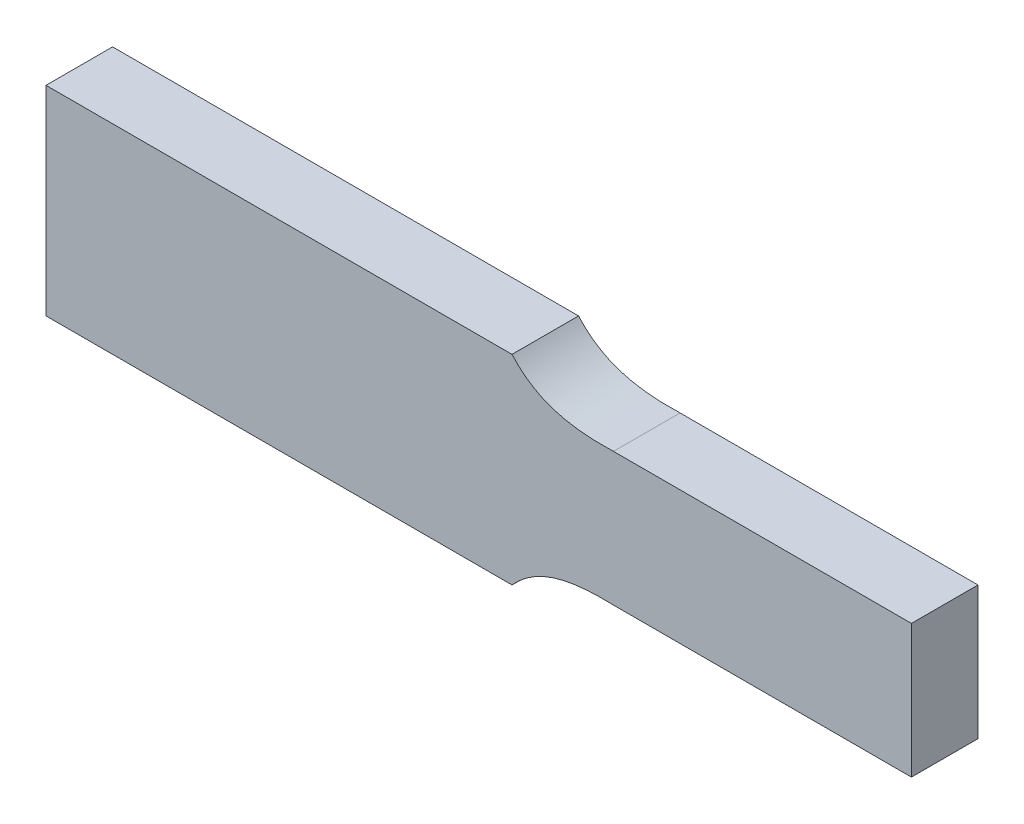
ISO-10303-21;
HEADER;
FILE_DESCRIPTION(('STEP AP214'),'2;1');
FILE_NAME('part.step','',(''),(''),'','','');
FILE_SCHEMA(('AUTOMOTIVE_DESIGN { 1 0 10303 214 1 1 1 1 }'));
ENDSEC;
DATA;
#1=APPLICATION_CONTEXT('core data for automotive mechanical design processes');
#2=APPLICATION_PROTOCOL_DEFINITION('international standard','automotive_design',2000,#1);
#3=PRODUCT_CONTEXT('',#1,'mechanical');
#4=PRODUCT('Part','Part','',(#3));
#5=PRODUCT_RELATED_PRODUCT_CATEGORY('part','',(#4));
#6=PRODUCT_DEFINITION_FORMATION('','',#4);
#7=PRODUCT_DEFINITION_CONTEXT('part definition',#1,'design');
#8=PRODUCT_DEFINITION('design','',#6,#7);
#9=PRODUCT_DEFINITION_SHAPE('','',#8);
#10=(LENGTH_UNIT() NAMED_UNIT(*) SI_UNIT(.MILLI.,.METRE.));
#11=(NAMED_UNIT(*) PLANE_ANGLE_UNIT() SI_UNIT($,.RADIAN.));
#12=(NAMED_UNIT(*) SI_UNIT($,.STERADIAN.) SOLID_ANGLE_UNIT());
#13=UNCERTAINTY_MEASURE_WITH_UNIT(LENGTH_MEASURE(1.E-05),#10,'distance_accuracy_value','');
#14=(GEOMETRIC_REPRESENTATION_CONTEXT(3) GLOBAL_UNCERTAINTY_ASSIGNED_CONTEXT((#13)) GLOBAL_UNIT_ASSIGNED_CONTEXT((#10,
#11,#12)) REPRESENTATION_CONTEXT('',''));
#15=CARTESIAN_POINT('',(0.,0.,0.));
#16=DIRECTION('',(0.,0.,1.));
#17=DIRECTION('',(1.,0.,0.));
#18=AXIS2_PLACEMENT_3D('',#15,#16,#17);
#19=CARTESIAN_POINT('',(0.,41.1830275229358,20.));
#20=DIRECTION('',(0.,-1.,0.));
#21=DIRECTION('',(1.,0.,0.));
#22=AXIS2_PLACEMENT_3D('',#19,#20,#21);
#23=PLANE('',#22);
#24=DIRECTION('',(-1.,0.,0.));
#25=VECTOR('',#24,1.);
#26=CARTESIAN_POINT('',(0.,41.1830275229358,0.));
#27=LINE('',#26,#25);
#28=CARTESIAN_POINT('',(140.,41.1830275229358,0.));
#29=VERTEX_POINT('',#28);
#30=CARTESIAN_POINT('',(0.,41.1830275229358,0.));
#31=VERTEX_POINT('',#30);
#32=EDGE_CURVE('E137',#29,#31,#27,.T.);
#33=ORIENTED_EDGE('',*,*,#32,.T.);
#34=DIRECTION('',(0.,0.,-1.));
#35=VECTOR('',#34,1.);
#36=CARTESIAN_POINT('',(0.,41.1830275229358,20.));
#37=LINE('',#36,#35);
#38=CARTESIAN_POINT('',(0.,41.1830275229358,20.));
#39=VERTEX_POINT('',#38);
#40=EDGE_CURVE('E11',#39,#31,#37,.T.);
#41=ORIENTED_EDGE('',*,*,#40,.F.);
#42=DIRECTION('',(-1.,0.,0.));
#43=VECTOR('',#42,1.);
#44=CARTESIAN_POINT('',(0.,41.1830275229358,20.));
#45=LINE('',#44,#43);
#46=CARTESIAN_POINT('',(140.,41.1830275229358,20.));
#47=VERTEX_POINT('',#46);
#48=EDGE_CURVE('E174',#47,#39,#45,.T.);
#49=ORIENTED_EDGE('',*,*,#48,.F.);
#50=DIRECTION('',(0.,0.,-1.));
#51=VECTOR('',#50,1.);
#52=CARTESIAN_POINT('',(140.,41.1830275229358,20.));
#53=LINE('',#52,#51);
#54=EDGE_CURVE('E130',#47,#29,#53,.T.);
#55=ORIENTED_EDGE('',*,*,#54,.T.);
#56=EDGE_LOOP('',(#33,#41,#49,#55));
#57=FACE_BOUND('',#56,.T.);
#58=ADVANCED_FACE('F38',(#57),#23,.F.);
#59=CARTESIAN_POINT('',(0.,-18.8169724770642,20.));
#60=DIRECTION('',(1.,0.,0.));
#61=DIRECTION('',(0.,0.,-1.));
#62=AXIS2_PLACEMENT_3D('',#59,#60,#61);
#63=PLANE('',#62);
#64=DIRECTION('',(0.,-1.,0.));
#65=VECTOR('',#64,1.);
#66=CARTESIAN_POINT('',(0.,-18.8169724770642,0.));
#67=LINE('',#66,#65);
#68=CARTESIAN_POINT('',(0.,-18.8169724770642,0.));
#69=VERTEX_POINT('',#68);
#70=EDGE_CURVE('E203',#31,#69,#67,.T.);
#71=ORIENTED_EDGE('',*,*,#70,.T.);
#72=DIRECTION('',(0.,0.,-1.));
#73=VECTOR('',#72,1.);
#74=CARTESIAN_POINT('',(0.,-18.8169724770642,20.));
#75=LINE('',#74,#73);
#76=CARTESIAN_POINT('',(0.,-18.8169724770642,20.));
#77=VERTEX_POINT('',#76);
#78=EDGE_CURVE('E46',#77,#69,#75,.T.);
#79=ORIENTED_EDGE('',*,*,#78,.F.);
#80=DIRECTION('',(0.,-1.,0.));
#81=VECTOR('',#80,1.);
#82=CARTESIAN_POINT('',(0.,-18.8169724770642,20.));
#83=LINE('',#82,#81);
#84=EDGE_CURVE('E97',#39,#77,#83,.T.);
#85=ORIENTED_EDGE('',*,*,#84,.F.);
#86=ORIENTED_EDGE('',*,*,#40,.T.);
#87=EDGE_LOOP('',(#71,#79,#85,#86));
#88=FACE_BOUND('',#87,.T.);
#89=ADVANCED_FACE('F218',(#88),#63,.F.);
#90=CARTESIAN_POINT('',(140.,-18.8169724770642,20.));
#91=DIRECTION('',(0.,1.,0.));
#92=DIRECTION('',(-1.,0.,0.));
#93=AXIS2_PLACEMENT_3D('',#90,#91,#92);
#94=PLANE('',#93);
#95=DIRECTION('',(1.,0.,0.));
#96=VECTOR('',#95,1.);
#97=CARTESIAN_POINT('',(140.,-18.8169724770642,0.));
#98=LINE('',#97,#96);
#99=CARTESIAN_POINT('',(140.,-18.8169724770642,0.));
#100=VERTEX_POINT('',#99);
#101=EDGE_CURVE('E199',#69,#100,#98,.T.);
#102=ORIENTED_EDGE('',*,*,#101,.T.);
#103=DIRECTION('',(0.,0.,-1.));
#104=VECTOR('',#103,1.);
#105=CARTESIAN_POINT('',(140.,-18.8169724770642,20.));
#106=LINE('',#105,#104);
#107=CARTESIAN_POINT('',(140.,-18.8169724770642,20.));
#108=VERTEX_POINT('',#107);
#109=EDGE_CURVE('E192',#108,#100,#106,.T.);
#110=ORIENTED_EDGE('',*,*,#109,.F.);
#111=DIRECTION('',(1.,0.,0.));
#112=VECTOR('',#111,1.);
#113=CARTESIAN_POINT('',(140.,-18.8169724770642,20.));
#114=LINE('',#113,#112);
#115=EDGE_CURVE('E168',#77,#108,#114,.T.);
#116=ORIENTED_EDGE('',*,*,#115,.F.);
#117=ORIENTED_EDGE('',*,*,#78,.T.);
#118=EDGE_LOOP('',(#102,#110,#116,#117));
#119=FACE_BOUND('',#118,.T.);
#120=ADVANCED_FACE('F161',(#119),#94,.F.);
#121=CARTESIAN_POINT('',(140.,-18.8169724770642,20.));
#122=CARTESIAN_POINT('',(142.236718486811,-16.2606598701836,20.));
#123=CARTESIAN_POINT('',(151.161976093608,-9.31456617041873,20.));
#124=CARTESIAN_POINT('',(162.987656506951,-8.57923036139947,20.));
#125=CARTESIAN_POINT('',(170.489829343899,-8.81697247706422,20.));
#126=B_SPLINE_CURVE_WITH_KNOTS('',3,(#121,#122,#123,#124,#125),.UNSPECIFIED.,.F.,.F.,(4,1,4),
(0.,0.308404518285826,1.),.UNSPECIFIED.);
#127=DIRECTION('',(0.,0.,-1.));
#128=VECTOR('',#127,1.);
#129=SURFACE_OF_LINEAR_EXTRUSION('',#126,#128);
#130=CARTESIAN_POINT('',(140.,-18.8169724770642,0.));
#131=CARTESIAN_POINT('',(142.236718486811,-16.2606598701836,0.));
#132=CARTESIAN_POINT('',(151.161976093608,-9.31456617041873,0.));
#133=CARTESIAN_POINT('',(162.987656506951,-8.57923036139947,0.));
#134=CARTESIAN_POINT('',(170.489829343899,-8.81697247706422,0.));
#135=B_SPLINE_CURVE_WITH_KNOTS('',3,(#130,#131,#132,#133,#134),.UNSPECIFIED.,.F.,.F.,(4,1,4),
(0.,0.308404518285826,1.),.UNSPECIFIED.);
#136=CARTESIAN_POINT('',(170.489829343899,-8.81697247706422,0.));
#137=VERTEX_POINT('',#136);
#138=EDGE_CURVE('E205',#100,#137,#135,.T.);
#139=ORIENTED_EDGE('',*,*,#138,.T.);
#140=DIRECTION('',(0.,0.,-1.));
#141=VECTOR('',#140,1.);
#142=CARTESIAN_POINT('',(170.489829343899,-8.81697247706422,20.));
#143=LINE('',#142,#141);
#144=CARTESIAN_POINT('',(170.489829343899,-8.81697247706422,20.));
#145=VERTEX_POINT('',#144);
#146=EDGE_CURVE('E189',#145,#137,#143,.T.);
#147=ORIENTED_EDGE('',*,*,#146,.F.);
#148=EDGE_CURVE('E163',#108,#145,#126,.T.);
#149=ORIENTED_EDGE('',*,*,#148,.F.);
#150=ORIENTED_EDGE('',*,*,#109,.T.);
#151=EDGE_LOOP('',(#139,#147,#149,#150));
#152=FACE_BOUND('',#151,.T.);
#153=ADVANCED_FACE('F156',(#152),#129,.F.);
#154=CARTESIAN_POINT('',(170.489829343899,-8.81697247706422,20.));
#155=DIRECTION('',(0.,1.,0.));
#156=DIRECTION('',(0.,0.,1.));
#157=AXIS2_PLACEMENT_3D('',#154,#155,#156);
#158=PLANE('',#157);
#159=DIRECTION('',(1.,0.,0.));
#160=VECTOR('',#159,1.);
#161=CARTESIAN_POINT('',(170.489829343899,-8.81697247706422,0.));
#162=LINE('',#161,#160);
#163=CARTESIAN_POINT('',(260.,-8.81697247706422,0.));
#164=VERTEX_POINT('',#163);
#165=EDGE_CURVE('E207',#137,#164,#162,.T.);
#166=ORIENTED_EDGE('',*,*,#165,.T.);
#167=DIRECTION('',(0.,0.,-1.));
#168=VECTOR('',#167,1.);
#169=CARTESIAN_POINT('',(260.,-8.81697247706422,20.));
#170=LINE('',#169,#168);
#171=CARTESIAN_POINT('',(260.,-8.81697247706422,20.));
#172=VERTEX_POINT('',#171);
#173=EDGE_CURVE('E125',#172,#164,#170,.T.);
#174=ORIENTED_EDGE('',*,*,#173,.F.);
#175=DIRECTION('',(1.,0.,0.));
#176=VECTOR('',#175,1.);
#177=CARTESIAN_POINT('',(170.489829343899,-8.81697247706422,20.));
#178=LINE('',#177,#176);
#179=EDGE_CURVE('E116',#145,#172,#178,.T.);
#180=ORIENTED_EDGE('',*,*,#179,.F.);
#181=ORIENTED_EDGE('',*,*,#146,.T.);
#182=EDGE_LOOP('',(#166,#174,#180,#181));
#183=FACE_BOUND('',#182,.T.);
#184=ADVANCED_FACE('F153',(#183),#158,.F.);
#185=CARTESIAN_POINT('',(260.,31.1830275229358,20.));
#186=DIRECTION('',(-1.,0.,0.));
#187=DIRECTION('',(0.,0.,1.));
#188=AXIS2_PLACEMENT_3D('',#185,#186,#187);
#189=PLANE('',#188);
#190=DIRECTION('',(0.,1.,0.));
#191=VECTOR('',#190,1.);
#192=CARTESIAN_POINT('',(260.,31.1830275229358,0.));
#193=LINE('',#192,#191);
#194=CARTESIAN_POINT('',(260.,31.1830275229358,0.));
#195=VERTEX_POINT('',#194);
#196=EDGE_CURVE('E124',#164,#195,#193,.T.);
#197=ORIENTED_EDGE('',*,*,#196,.T.);
#198=DIRECTION('',(0.,0.,-1.));
#199=VECTOR('',#198,1.);
#200=CARTESIAN_POINT('',(260.,31.1830275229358,20.));
#201=LINE('',#200,#199);
#202=CARTESIAN_POINT('',(260.,31.1830275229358,20.));
#203=VERTEX_POINT('',#202);
#204=EDGE_CURVE('E121',#203,#195,#201,.T.);
#205=ORIENTED_EDGE('',*,*,#204,.F.);
#206=DIRECTION('',(0.,1.,0.));
#207=VECTOR('',#206,1.);
#208=CARTESIAN_POINT('',(260.,31.1830275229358,20.));
#209=LINE('',#208,#207);
#210=EDGE_CURVE('E110',#172,#203,#209,.T.);
#211=ORIENTED_EDGE('',*,*,#210,.F.);
#212=ORIENTED_EDGE('',*,*,#173,.T.);
#213=EDGE_LOOP('',(#197,#205,#211,#212));
#214=FACE_BOUND('',#213,.T.);
#215=ADVANCED_FACE('F122',(#214),#189,.F.);
#216=CARTESIAN_POINT('',(170.489829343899,31.1830275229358,20.));
#217=DIRECTION('',(0.,-1.,0.));
#218=DIRECTION('',(0.,0.,-1.));
#219=AXIS2_PLACEMENT_3D('',#216,#217,#218);
#220=PLANE('',#219);
#221=DIRECTION('',(-1.,0.,0.));
#222=VECTOR('',#221,1.);
#223=CARTESIAN_POINT('',(170.489829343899,31.1830275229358,0.));
#224=LINE('',#223,#222);
#225=CARTESIAN_POINT('',(170.489829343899,31.1830275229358,0.));
#226=VERTEX_POINT('',#225);
#227=EDGE_CURVE('E83',#195,#226,#224,.T.);
#228=ORIENTED_EDGE('',*,*,#227,.T.);
#229=DIRECTION('',(0.,0.,-1.));
#230=VECTOR('',#229,1.);
#231=CARTESIAN_POINT('',(170.489829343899,31.1830275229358,20.));
#232=LINE('',#231,#230);
#233=CARTESIAN_POINT('',(170.489829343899,31.1830275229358,20.));
#234=VERTEX_POINT('',#233);
#235=EDGE_CURVE('E126',#234,#226,#232,.T.);
#236=ORIENTED_EDGE('',*,*,#235,.F.);
#237=DIRECTION('',(-1.,0.,0.));
#238=VECTOR('',#237,1.);
#239=CARTESIAN_POINT('',(170.489829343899,31.1830275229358,20.));
#240=LINE('',#239,#238);
#241=EDGE_CURVE('E114',#203,#234,#240,.T.);
#242=ORIENTED_EDGE('',*,*,#241,.F.);
#243=ORIENTED_EDGE('',*,*,#204,.T.);
#244=EDGE_LOOP('',(#228,#236,#242,#243));
#245=FACE_BOUND('',#244,.T.);
#246=ADVANCED_FACE('F128',(#245),#220,.F.);
#247=CARTESIAN_POINT('',(170.489829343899,31.1830275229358,20.));
#248=CARTESIAN_POINT('',(162.987656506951,30.945285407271,20.));
#249=CARTESIAN_POINT('',(151.161976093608,31.6806212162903,20.));
#250=CARTESIAN_POINT('',(142.236718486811,38.6267149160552,20.));
#251=CARTESIAN_POINT('',(140.,41.1830275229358,20.));
#252=B_SPLINE_CURVE_WITH_KNOTS('',3,(#247,#248,#249,#250,#251),.UNSPECIFIED.,.F.,.F.,(4,1,4),
(0.,0.691595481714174,1.),.UNSPECIFIED.);
#253=DIRECTION('',(0.,0.,-1.));
#254=VECTOR('',#253,1.);
#255=SURFACE_OF_LINEAR_EXTRUSION('',#252,#254);
#256=CARTESIAN_POINT('',(170.489829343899,31.1830275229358,0.));
#257=CARTESIAN_POINT('',(162.987656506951,30.945285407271,0.));
#258=CARTESIAN_POINT('',(151.161976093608,31.6806212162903,0.));
#259=CARTESIAN_POINT('',(142.236718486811,38.6267149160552,0.));
#260=CARTESIAN_POINT('',(140.,41.1830275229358,0.));
#261=B_SPLINE_CURVE_WITH_KNOTS('',3,(#256,#257,#258,#259,#260),.UNSPECIFIED.,.F.,.F.,(4,1,4),
(0.,0.691595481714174,1.),.UNSPECIFIED.);
#262=EDGE_CURVE('E89',#226,#29,#261,.T.);
#263=ORIENTED_EDGE('',*,*,#262,.T.);
#264=ORIENTED_EDGE('',*,*,#54,.F.);
#265=EDGE_CURVE('E54',#234,#47,#252,.T.);
#266=ORIENTED_EDGE('',*,*,#265,.F.);
#267=ORIENTED_EDGE('',*,*,#235,.T.);
#268=EDGE_LOOP('',(#263,#264,#266,#267));
#269=FACE_BOUND('',#268,.T.);
#270=ADVANCED_FACE('F143',(#269),#255,.F.);
#271=CARTESIAN_POINT('',(153.937568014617,32.6781434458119,20.));
#272=DIRECTION('',(0.,0.,1.));
#273=DIRECTION('',(1.,0.,0.));
#274=AXIS2_PLACEMENT_3D('',#271,#272,#273);
#275=PLANE('',#274);
#276=ORIENTED_EDGE('',*,*,#48,.T.);
#277=ORIENTED_EDGE('',*,*,#84,.T.);
#278=ORIENTED_EDGE('',*,*,#115,.T.);
#279=ORIENTED_EDGE('',*,*,#148,.T.);
#280=ORIENTED_EDGE('',*,*,#179,.T.);
#281=ORIENTED_EDGE('',*,*,#210,.T.);
#282=ORIENTED_EDGE('',*,*,#241,.T.);
#283=ORIENTED_EDGE('',*,*,#265,.T.);
#284=EDGE_LOOP('',(#276,#277,#278,#279,#280,#281,#282,#283));
#285=FACE_BOUND('',#284,.T.);
#286=ADVANCED_FACE('F112',(#285),#275,.T.);
#287=CARTESIAN_POINT('',(153.937568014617,32.6781434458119,0.));
#288=DIRECTION('',(0.,0.,1.));
#289=DIRECTION('',(1.,0.,0.));
#290=AXIS2_PLACEMENT_3D('',#287,#288,#289);
#291=PLANE('',#290);
#292=ORIENTED_EDGE('',*,*,#32,.F.);
#293=ORIENTED_EDGE('',*,*,#262,.F.);
#294=ORIENTED_EDGE('',*,*,#227,.F.);
#295=ORIENTED_EDGE('',*,*,#196,.F.);
#296=ORIENTED_EDGE('',*,*,#165,.F.);
#297=ORIENTED_EDGE('',*,*,#138,.F.);
#298=ORIENTED_EDGE('',*,*,#101,.F.);
#299=ORIENTED_EDGE('',*,*,#70,.F.);
#300=EDGE_LOOP('',(#292,#293,#294,#295,#296,#297,#298,#299));
#301=FACE_BOUND('',#300,.T.);
#302=ADVANCED_FACE('F147',(#301),#291,.F.);
#303=CLOSED_SHELL('',(#58,#89,#120,#153,#184,#215,#246,#270,#286,#302));
#304=MANIFOLD_SOLID_BREP('B2',#303);
#305=ADVANCED_BREP_SHAPE_REPRESENTATION('',(#18,#304),#14);
#306=SHAPE_DEFINITION_REPRESENTATION(#9,#305);
ENDSEC;
END-ISO-10303-21;
